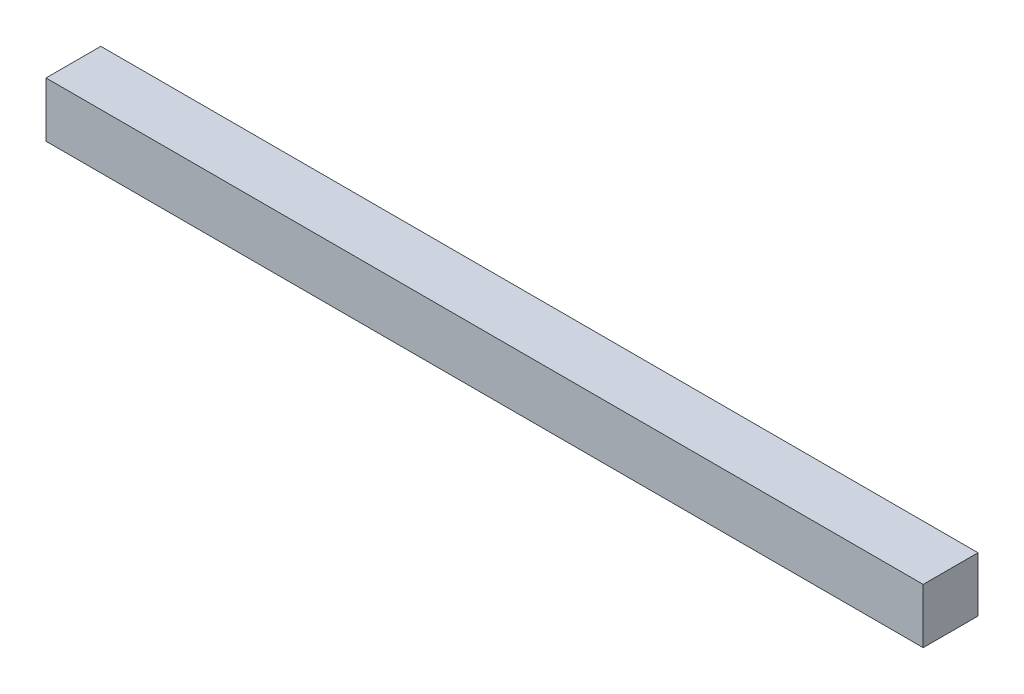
ISO-10303-21;
HEADER;
FILE_DESCRIPTION(('STEP AP214'),'2;1');
FILE_NAME('part.step','',(''),(''),'','','');
FILE_SCHEMA(('AUTOMOTIVE_DESIGN { 1 0 10303 214 1 1 1 1 }'));
ENDSEC;
DATA;
#1=APPLICATION_CONTEXT('core data for automotive mechanical design processes');
#2=APPLICATION_PROTOCOL_DEFINITION('international standard','automotive_design',2000,#1);
#3=PRODUCT_CONTEXT('',#1,'mechanical');
#4=PRODUCT('Part','Part','',(#3));
#5=PRODUCT_RELATED_PRODUCT_CATEGORY('part','',(#4));
#6=PRODUCT_DEFINITION_FORMATION('','',#4);
#7=PRODUCT_DEFINITION_CONTEXT('part definition',#1,'design');
#8=PRODUCT_DEFINITION('design','',#6,#7);
#9=PRODUCT_DEFINITION_SHAPE('','',#8);
#10=(LENGTH_UNIT() NAMED_UNIT(*) SI_UNIT(.MILLI.,.METRE.));
#11=(NAMED_UNIT(*) PLANE_ANGLE_UNIT() SI_UNIT($,.RADIAN.));
#12=(NAMED_UNIT(*) SI_UNIT($,.STERADIAN.) SOLID_ANGLE_UNIT());
#13=UNCERTAINTY_MEASURE_WITH_UNIT(LENGTH_MEASURE(1.E-05),#10,'distance_accuracy_value','');
#14=(GEOMETRIC_REPRESENTATION_CONTEXT(3) GLOBAL_UNCERTAINTY_ASSIGNED_CONTEXT((#13)) GLOBAL_UNIT_ASSIGNED_CONTEXT((#10,
#11,#12)) REPRESENTATION_CONTEXT('',''));
#15=CARTESIAN_POINT('',(0.,0.,0.));
#16=DIRECTION('',(0.,0.,1.));
#17=DIRECTION('',(1.,0.,0.));
#18=AXIS2_PLACEMENT_3D('',#15,#16,#17);
#19=CARTESIAN_POINT('',(101.6,0.,0.));
#20=DIRECTION('',(0.,0.,-1.));
#21=DIRECTION('',(-1.,0.,0.));
#22=AXIS2_PLACEMENT_3D('',#19,#20,#21);
#23=PLANE('',#22);
#24=DIRECTION('',(0.,-1.,0.));
#25=VECTOR('',#24,1.);
#26=CARTESIAN_POINT('',(0.,0.,0.));
#27=LINE('',#26,#25);
#28=CARTESIAN_POINT('',(0.,6.35,0.));
#29=VERTEX_POINT('',#28);
#30=CARTESIAN_POINT('',(0.,0.,0.));
#31=VERTEX_POINT('',#30);
#32=EDGE_CURVE('E74',#29,#31,#27,.T.);
#33=ORIENTED_EDGE('',*,*,#32,.T.);
#34=DIRECTION('',(-1.,0.,0.));
#35=VECTOR('',#34,1.);
#36=CARTESIAN_POINT('',(101.6,0.,0.));
#37=LINE('',#36,#35);
#38=CARTESIAN_POINT('',(101.6,0.,0.));
#39=VERTEX_POINT('',#38);
#40=EDGE_CURVE('E11',#39,#31,#37,.T.);
#41=ORIENTED_EDGE('',*,*,#40,.F.);
#42=DIRECTION('',(0.,-1.,0.));
#43=VECTOR('',#42,1.);
#44=CARTESIAN_POINT('',(101.6,0.,0.));
#45=LINE('',#44,#43);
#46=CARTESIAN_POINT('',(101.6,6.35,0.));
#47=VERTEX_POINT('',#46);
#48=EDGE_CURVE('E92',#47,#39,#45,.T.);
#49=ORIENTED_EDGE('',*,*,#48,.F.);
#50=DIRECTION('',(-1.,0.,0.));
#51=VECTOR('',#50,1.);
#52=CARTESIAN_POINT('',(101.6,6.35,0.));
#53=LINE('',#52,#51);
#54=EDGE_CURVE('E86',#47,#29,#53,.T.);
#55=ORIENTED_EDGE('',*,*,#54,.T.);
#56=EDGE_LOOP('',(#33,#41,#49,#55));
#57=FACE_BOUND('',#56,.T.);
#58=ADVANCED_FACE('F30',(#57),#23,.F.);
#59=CARTESIAN_POINT('',(101.6,0.,0.));
#60=DIRECTION('',(0.,1.,0.));
#61=DIRECTION('',(0.,0.,1.));
#62=AXIS2_PLACEMENT_3D('',#59,#60,#61);
#63=PLANE('',#62);
#64=DIRECTION('',(0.,0.,-1.));
#65=VECTOR('',#64,1.);
#66=CARTESIAN_POINT('',(0.,0.,0.));
#67=LINE('',#66,#65);
#68=CARTESIAN_POINT('',(0.,0.,-6.35));
#69=VERTEX_POINT('',#68);
#70=EDGE_CURVE('E70',#31,#69,#67,.T.);
#71=ORIENTED_EDGE('',*,*,#70,.T.);
#72=DIRECTION('',(-1.,0.,0.));
#73=VECTOR('',#72,1.);
#74=CARTESIAN_POINT('',(101.6,0.,-6.35));
#75=LINE('',#74,#73);
#76=CARTESIAN_POINT('',(101.6,0.,-6.35));
#77=VERTEX_POINT('',#76);
#78=EDGE_CURVE('E37',#77,#69,#75,.T.);
#79=ORIENTED_EDGE('',*,*,#78,.F.);
#80=DIRECTION('',(0.,0.,-1.));
#81=VECTOR('',#80,1.);
#82=CARTESIAN_POINT('',(101.6,0.,0.));
#83=LINE('',#82,#81);
#84=EDGE_CURVE('E82',#39,#77,#83,.T.);
#85=ORIENTED_EDGE('',*,*,#84,.F.);
#86=ORIENTED_EDGE('',*,*,#40,.T.);
#87=EDGE_LOOP('',(#71,#79,#85,#86));
#88=FACE_BOUND('',#87,.T.);
#89=ADVANCED_FACE('F81',(#88),#63,.F.);
#90=CARTESIAN_POINT('',(101.6,0.,-6.35));
#91=DIRECTION('',(0.,0.,1.));
#92=DIRECTION('',(1.,0.,0.));
#93=AXIS2_PLACEMENT_3D('',#90,#91,#92);
#94=PLANE('',#93);
#95=DIRECTION('',(0.,1.,0.));
#96=VECTOR('',#95,1.);
#97=CARTESIAN_POINT('',(0.,0.,-6.35));
#98=LINE('',#97,#96);
#99=CARTESIAN_POINT('',(0.,6.35,-6.35));
#100=VERTEX_POINT('',#99);
#101=EDGE_CURVE('E75',#69,#100,#98,.T.);
#102=ORIENTED_EDGE('',*,*,#101,.T.);
#103=DIRECTION('',(-1.,0.,0.));
#104=VECTOR('',#103,1.);
#105=CARTESIAN_POINT('',(101.6,6.35,-6.35));
#106=LINE('',#105,#104);
#107=CARTESIAN_POINT('',(101.6,6.35,-6.35));
#108=VERTEX_POINT('',#107);
#109=EDGE_CURVE('E98',#108,#100,#106,.T.);
#110=ORIENTED_EDGE('',*,*,#109,.F.);
#111=DIRECTION('',(0.,1.,0.));
#112=VECTOR('',#111,1.);
#113=CARTESIAN_POINT('',(101.6,0.,-6.35));
#114=LINE('',#113,#112);
#115=EDGE_CURVE('E49',#77,#108,#114,.T.);
#116=ORIENTED_EDGE('',*,*,#115,.F.);
#117=ORIENTED_EDGE('',*,*,#78,.T.);
#118=EDGE_LOOP('',(#102,#110,#116,#117));
#119=FACE_BOUND('',#118,.T.);
#120=ADVANCED_FACE('F101',(#119),#94,.F.);
#121=CARTESIAN_POINT('',(101.6,6.35,0.));
#122=DIRECTION('',(0.,-1.,0.));
#123=DIRECTION('',(0.,0.,-1.));
#124=AXIS2_PLACEMENT_3D('',#121,#122,#123);
#125=PLANE('',#124);
#126=DIRECTION('',(0.,0.,1.));
#127=VECTOR('',#126,1.);
#128=CARTESIAN_POINT('',(0.,6.35,0.));
#129=LINE('',#128,#127);
#130=EDGE_CURVE('E90',#100,#29,#129,.T.);
#131=ORIENTED_EDGE('',*,*,#130,.T.);
#132=ORIENTED_EDGE('',*,*,#54,.F.);
#133=DIRECTION('',(0.,0.,1.));
#134=VECTOR('',#133,1.);
#135=CARTESIAN_POINT('',(101.6,6.35,0.));
#136=LINE('',#135,#134);
#137=EDGE_CURVE('E44',#108,#47,#136,.T.);
#138=ORIENTED_EDGE('',*,*,#137,.F.);
#139=ORIENTED_EDGE('',*,*,#109,.T.);
#140=EDGE_LOOP('',(#131,#132,#138,#139));
#141=FACE_BOUND('',#140,.T.);
#142=ADVANCED_FACE('F103',(#141),#125,.F.);
#143=CARTESIAN_POINT('',(101.6,6.35,0.));
#144=DIRECTION('',(-1.,0.,0.));
#145=DIRECTION('',(0.,0.,1.));
#146=AXIS2_PLACEMENT_3D('',#143,#144,#145);
#147=PLANE('',#146);
#148=ORIENTED_EDGE('',*,*,#48,.T.);
#149=ORIENTED_EDGE('',*,*,#84,.T.);
#150=ORIENTED_EDGE('',*,*,#115,.T.);
#151=ORIENTED_EDGE('',*,*,#137,.T.);
#152=EDGE_LOOP('',(#148,#149,#150,#151));
#153=FACE_BOUND('',#152,.T.);
#154=ADVANCED_FACE('F104',(#153),#147,.F.);
#155=CARTESIAN_POINT('',(0.,6.35,0.));
#156=DIRECTION('',(-1.,0.,0.));
#157=DIRECTION('',(0.,0.,1.));
#158=AXIS2_PLACEMENT_3D('',#155,#156,#157);
#159=PLANE('',#158);
#160=ORIENTED_EDGE('',*,*,#32,.F.);
#161=ORIENTED_EDGE('',*,*,#130,.F.);
#162=ORIENTED_EDGE('',*,*,#101,.F.);
#163=ORIENTED_EDGE('',*,*,#70,.F.);
#164=EDGE_LOOP('',(#160,#161,#162,#163));
#165=FACE_BOUND('',#164,.T.);
#166=ADVANCED_FACE('F71',(#165),#159,.T.);
#167=CLOSED_SHELL('',(#58,#89,#120,#142,#154,#166));
#168=MANIFOLD_SOLID_BREP('B2',#167);
#169=ADVANCED_BREP_SHAPE_REPRESENTATION('',(#18,#168),#14);
#170=SHAPE_DEFINITION_REPRESENTATION(#9,#169);
ENDSEC;
END-ISO-10303-21;
